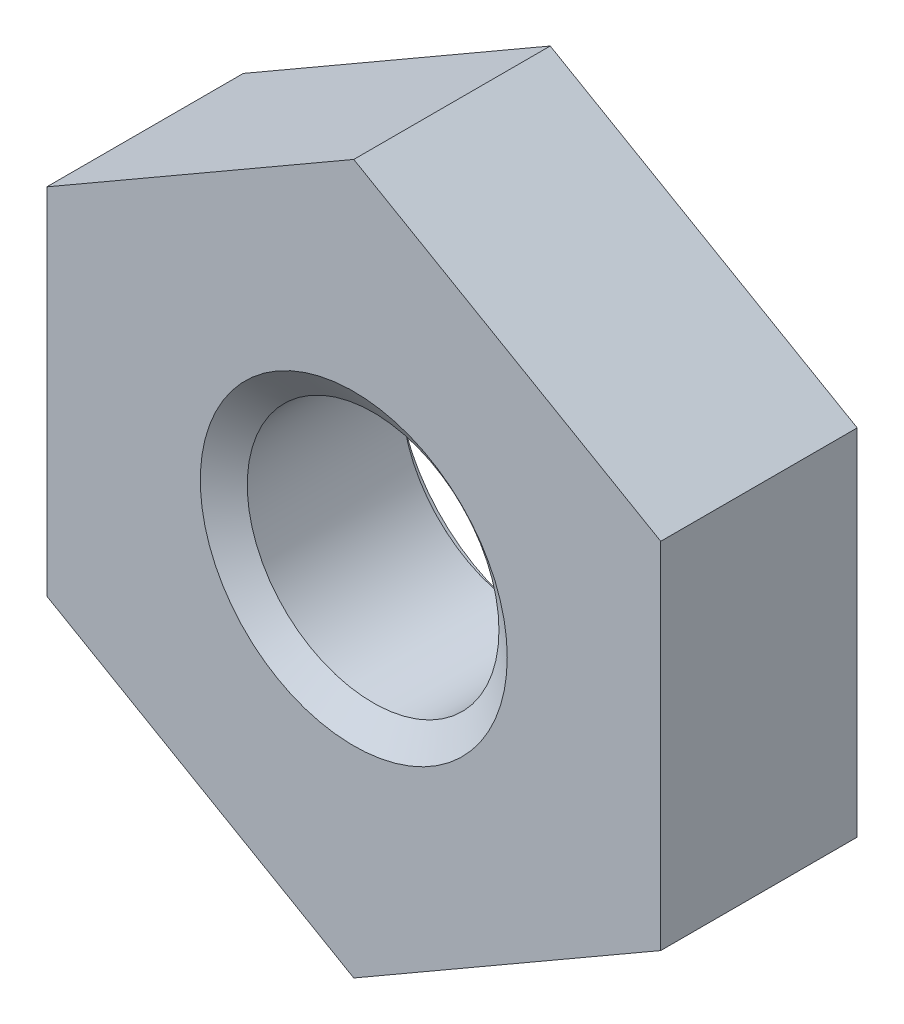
ISO-10303-21;
HEADER;
FILE_DESCRIPTION(('STEP AP214'),'2;1');
FILE_NAME('part.step','',(''),(''),'','','');
FILE_SCHEMA(('AUTOMOTIVE_DESIGN { 1 0 10303 214 1 1 1 1 }'));
ENDSEC;
DATA;
#1=APPLICATION_CONTEXT('core data for automotive mechanical design processes');
#2=APPLICATION_PROTOCOL_DEFINITION('international standard','automotive_design',2000,#1);
#3=PRODUCT_CONTEXT('',#1,'mechanical');
#4=PRODUCT('Part','Part','',(#3));
#5=PRODUCT_RELATED_PRODUCT_CATEGORY('part','',(#4));
#6=PRODUCT_DEFINITION_FORMATION('','',#4);
#7=PRODUCT_DEFINITION_CONTEXT('part definition',#1,'design');
#8=PRODUCT_DEFINITION('design','',#6,#7);
#9=PRODUCT_DEFINITION_SHAPE('','',#8);
#10=(LENGTH_UNIT() NAMED_UNIT(*) SI_UNIT(.MILLI.,.METRE.));
#11=(NAMED_UNIT(*) PLANE_ANGLE_UNIT() SI_UNIT($,.RADIAN.));
#12=(NAMED_UNIT(*) SI_UNIT($,.STERADIAN.) SOLID_ANGLE_UNIT());
#13=UNCERTAINTY_MEASURE_WITH_UNIT(LENGTH_MEASURE(1.E-05),#10,'distance_accuracy_value','');
#14=(GEOMETRIC_REPRESENTATION_CONTEXT(3) GLOBAL_UNCERTAINTY_ASSIGNED_CONTEXT((#13)) GLOBAL_UNIT_ASSIGNED_CONTEXT((#10,
#11,#12)) REPRESENTATION_CONTEXT('',''));
#15=CARTESIAN_POINT('',(0.,0.,0.));
#16=DIRECTION('',(0.,0.,1.));
#17=DIRECTION('',(1.,0.,0.));
#18=AXIS2_PLACEMENT_3D('',#15,#16,#17);
#19=CARTESIAN_POINT('',(0.,0.,-1.6));
#20=DIRECTION('',(0.,0.,1.));
#21=DIRECTION('',(1.,0.,0.));
#22=AXIS2_PLACEMENT_3D('',#19,#20,#21);
#23=CYLINDRICAL_SURFACE('',#22,1.025);
#24=CARTESIAN_POINT('',(0.,0.,-0.157546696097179));
#25=DIRECTION('',(0.,0.,1.));
#26=DIRECTION('',(1.,0.,0.));
#27=AXIS2_PLACEMENT_3D('',#24,#25,#26);
#28=CIRCLE('',#27,1.025);
#29=CARTESIAN_POINT('',(1.025,0.,-0.157546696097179));
#30=VERTEX_POINT('',#29);
#31=EDGE_CURVE('E101',#30,#30,#28,.F.);
#32=ORIENTED_EDGE('',*,*,#31,.F.);
#33=EDGE_LOOP('',(#32));
#34=FACE_BOUND('',#33,.T.);
#35=CARTESIAN_POINT('',(0.,0.,-1.41705330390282));
#36=DIRECTION('',(0.,0.,-1.));
#37=DIRECTION('',(-1.,0.,0.));
#38=AXIS2_PLACEMENT_3D('',#35,#36,#37);
#39=CIRCLE('',#38,1.025);
#40=CARTESIAN_POINT('',(-1.025,0.,-1.41705330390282));
#41=VERTEX_POINT('',#40);
#42=EDGE_CURVE('E30',#41,#41,#39,.F.);
#43=ORIENTED_EDGE('',*,*,#42,.F.);
#44=EDGE_LOOP('',(#43));
#45=FACE_BOUND('',#44,.T.);
#46=ADVANCED_FACE('F26',(#34,#45),#23,.F.);
#47=CARTESIAN_POINT('',(-4.99999999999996,0.,-1.6));
#48=DIRECTION('',(0.,0.,1.));
#49=DIRECTION('',(1.,0.,0.));
#50=AXIS2_PLACEMENT_3D('',#47,#48,#49);
#51=PLANE('',#50);
#52=DIRECTION('',(-0.866025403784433,-0.500000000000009,0.));
#53=VECTOR('',#52,1.);
#54=CARTESIAN_POINT('',(0.,2.88675134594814,-1.6));
#55=LINE('',#54,#53);
#56=CARTESIAN_POINT('',(0.,2.88675134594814,-1.6));
#57=VERTEX_POINT('',#56);
#58=CARTESIAN_POINT('',(-2.5,1.44337567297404,-1.6));
#59=VERTEX_POINT('',#58);
#60=EDGE_CURVE('E82',#57,#59,#55,.T.);
#61=ORIENTED_EDGE('',*,*,#60,.F.);
#62=DIRECTION('',(-0.866025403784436,0.500000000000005,0.));
#63=VECTOR('',#62,1.);
#64=CARTESIAN_POINT('',(2.5,1.44337567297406,-1.6));
#65=LINE('',#64,#63);
#66=CARTESIAN_POINT('',(2.5,1.44337567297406,-1.6));
#67=VERTEX_POINT('',#66);
#68=EDGE_CURVE('E87',#67,#57,#65,.T.);
#69=ORIENTED_EDGE('',*,*,#68,.F.);
#70=DIRECTION('',(0.,-1.,0.));
#71=VECTOR('',#70,1.);
#72=CARTESIAN_POINT('',(2.5,1.44337567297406,-1.6));
#73=LINE('',#72,#71);
#74=CARTESIAN_POINT('',(2.5,-1.44337567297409,-1.6));
#75=VERTEX_POINT('',#74);
#76=EDGE_CURVE('E126',#67,#75,#73,.T.);
#77=ORIENTED_EDGE('',*,*,#76,.T.);
#78=DIRECTION('',(0.866025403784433,0.50000000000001,0.));
#79=VECTOR('',#78,1.);
#80=CARTESIAN_POINT('',(0.,-2.88675134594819,-1.6));
#81=LINE('',#80,#79);
#82=CARTESIAN_POINT('',(0.,-2.88675134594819,-1.6));
#83=VERTEX_POINT('',#82);
#84=EDGE_CURVE('E123',#83,#75,#81,.T.);
#85=ORIENTED_EDGE('',*,*,#84,.F.);
#86=DIRECTION('',(0.866025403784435,-0.500000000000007,0.));
#87=VECTOR('',#86,1.);
#88=CARTESIAN_POINT('',(-2.5,-1.4433756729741,-1.6));
#89=LINE('',#88,#87);
#90=CARTESIAN_POINT('',(-2.5,-1.4433756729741,-1.6));
#91=VERTEX_POINT('',#90);
#92=EDGE_CURVE('E120',#91,#83,#89,.T.);
#93=ORIENTED_EDGE('',*,*,#92,.F.);
#94=DIRECTION('',(0.,-1.,0.));
#95=VECTOR('',#94,1.);
#96=CARTESIAN_POINT('',(-2.5,1.44337567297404,-1.6));
#97=LINE('',#96,#95);
#98=EDGE_CURVE('E118',#59,#91,#97,.T.);
#99=ORIENTED_EDGE('',*,*,#98,.F.);
#100=EDGE_LOOP('',(#61,#69,#77,#85,#93,#99));
#101=FACE_BOUND('',#100,.T.);
#102=CARTESIAN_POINT('',(0.,0.,-1.6));
#103=DIRECTION('',(0.,0.,1.));
#104=DIRECTION('',(1.,0.,0.));
#105=AXIS2_PLACEMENT_3D('',#102,#103,#104);
#106=CIRCLE('',#105,1.25);
#107=CARTESIAN_POINT('',(1.25,0.,-1.6));
#108=VERTEX_POINT('',#107);
#109=EDGE_CURVE('E134',#108,#108,#106,.F.);
#110=ORIENTED_EDGE('',*,*,#109,.F.);
#111=EDGE_LOOP('',(#110));
#112=FACE_BOUND('',#111,.T.);
#113=ADVANCED_FACE('F153',(#101,#112),#51,.F.);
#114=CARTESIAN_POINT('',(-4.99999999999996,0.,0.));
#115=DIRECTION('',(0.,0.,1.));
#116=DIRECTION('',(1.,0.,0.));
#117=AXIS2_PLACEMENT_3D('',#114,#115,#116);
#118=PLANE('',#117);
#119=DIRECTION('',(-0.866025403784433,-0.500000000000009,0.));
#120=VECTOR('',#119,1.);
#121=CARTESIAN_POINT('',(0.,2.88675134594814,0.));
#122=LINE('',#121,#120);
#123=CARTESIAN_POINT('',(0.,2.88675134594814,0.));
#124=VERTEX_POINT('',#123);
#125=CARTESIAN_POINT('',(-2.5,1.44337567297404,0.));
#126=VERTEX_POINT('',#125);
#127=EDGE_CURVE('E80',#124,#126,#122,.T.);
#128=ORIENTED_EDGE('',*,*,#127,.T.);
#129=DIRECTION('',(0.,-1.,0.));
#130=VECTOR('',#129,1.);
#131=CARTESIAN_POINT('',(-2.5,1.44337567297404,0.));
#132=LINE('',#131,#130);
#133=CARTESIAN_POINT('',(-2.5,-1.4433756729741,0.));
#134=VERTEX_POINT('',#133);
#135=EDGE_CURVE('E90',#126,#134,#132,.T.);
#136=ORIENTED_EDGE('',*,*,#135,.T.);
#137=DIRECTION('',(0.866025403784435,-0.500000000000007,0.));
#138=VECTOR('',#137,1.);
#139=CARTESIAN_POINT('',(-2.5,-1.4433756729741,0.));
#140=LINE('',#139,#138);
#141=CARTESIAN_POINT('',(0.,-2.88675134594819,0.));
#142=VERTEX_POINT('',#141);
#143=EDGE_CURVE('E95',#134,#142,#140,.T.);
#144=ORIENTED_EDGE('',*,*,#143,.T.);
#145=DIRECTION('',(0.866025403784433,0.50000000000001,0.));
#146=VECTOR('',#145,1.);
#147=CARTESIAN_POINT('',(0.,-2.88675134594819,0.));
#148=LINE('',#147,#146);
#149=CARTESIAN_POINT('',(2.5,-1.44337567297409,0.));
#150=VERTEX_POINT('',#149);
#151=EDGE_CURVE('E110',#142,#150,#148,.T.);
#152=ORIENTED_EDGE('',*,*,#151,.T.);
#153=DIRECTION('',(0.,-1.,0.));
#154=VECTOR('',#153,1.);
#155=CARTESIAN_POINT('',(2.5,1.44337567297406,0.));
#156=LINE('',#155,#154);
#157=CARTESIAN_POINT('',(2.5,1.44337567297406,0.));
#158=VERTEX_POINT('',#157);
#159=EDGE_CURVE('E113',#158,#150,#156,.T.);
#160=ORIENTED_EDGE('',*,*,#159,.F.);
#161=DIRECTION('',(-0.866025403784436,0.500000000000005,0.));
#162=VECTOR('',#161,1.);
#163=CARTESIAN_POINT('',(2.5,1.44337567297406,0.));
#164=LINE('',#163,#162);
#165=EDGE_CURVE('E100',#158,#124,#164,.T.);
#166=ORIENTED_EDGE('',*,*,#165,.T.);
#167=EDGE_LOOP('',(#128,#136,#144,#152,#160,#166));
#168=FACE_BOUND('',#167,.T.);
#169=CARTESIAN_POINT('',(0.,0.,0.));
#170=DIRECTION('',(0.,0.,1.));
#171=DIRECTION('',(1.,0.,0.));
#172=AXIS2_PLACEMENT_3D('',#169,#170,#171);
#173=CIRCLE('',#172,1.25);
#174=CARTESIAN_POINT('',(1.25,0.,0.));
#175=VERTEX_POINT('',#174);
#176=EDGE_CURVE('E104',#175,#175,#173,.T.);
#177=ORIENTED_EDGE('',*,*,#176,.F.);
#178=EDGE_LOOP('',(#177));
#179=FACE_BOUND('',#178,.T.);
#180=ADVANCED_FACE('F97',(#168,#179),#118,.T.);
#181=CARTESIAN_POINT('',(0.,2.88675134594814,-1.6));
#182=DIRECTION('',(-0.500000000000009,0.866025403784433,0.));
#183=DIRECTION('',(-0.866025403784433,-0.500000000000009,0.));
#184=AXIS2_PLACEMENT_3D('',#181,#182,#183);
#185=PLANE('',#184);
#186=ORIENTED_EDGE('',*,*,#127,.F.);
#187=DIRECTION('',(0.,0.,1.));
#188=VECTOR('',#187,1.);
#189=CARTESIAN_POINT('',(0.,2.88675134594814,-1.6));
#190=LINE('',#189,#188);
#191=EDGE_CURVE('E11',#57,#124,#190,.T.);
#192=ORIENTED_EDGE('',*,*,#191,.F.);
#193=ORIENTED_EDGE('',*,*,#60,.T.);
#194=DIRECTION('',(0.,0.,1.));
#195=VECTOR('',#194,1.);
#196=CARTESIAN_POINT('',(-2.5,1.44337567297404,-1.6));
#197=LINE('',#196,#195);
#198=EDGE_CURVE('E77',#59,#126,#197,.T.);
#199=ORIENTED_EDGE('',*,*,#198,.T.);
#200=EDGE_LOOP('',(#186,#192,#193,#199));
#201=FACE_BOUND('',#200,.T.);
#202=ADVANCED_FACE('F28',(#201),#185,.T.);
#203=CARTESIAN_POINT('',(2.5,1.44337567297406,-1.6));
#204=DIRECTION('',(0.500000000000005,0.866025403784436,0.));
#205=DIRECTION('',(-0.866025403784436,0.500000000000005,0.));
#206=AXIS2_PLACEMENT_3D('',#203,#204,#205);
#207=PLANE('',#206);
#208=ORIENTED_EDGE('',*,*,#165,.F.);
#209=DIRECTION('',(0.,0.,1.));
#210=VECTOR('',#209,1.);
#211=CARTESIAN_POINT('',(2.5,1.44337567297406,-1.6));
#212=LINE('',#211,#210);
#213=EDGE_CURVE('E35',#67,#158,#212,.T.);
#214=ORIENTED_EDGE('',*,*,#213,.F.);
#215=ORIENTED_EDGE('',*,*,#68,.T.);
#216=ORIENTED_EDGE('',*,*,#191,.T.);
#217=EDGE_LOOP('',(#208,#214,#215,#216));
#218=FACE_BOUND('',#217,.T.);
#219=ADVANCED_FACE('F168',(#218),#207,.T.);
#220=CARTESIAN_POINT('',(2.5,1.44337567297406,-1.6));
#221=DIRECTION('',(-1.,0.,0.));
#222=DIRECTION('',(0.,0.,1.));
#223=AXIS2_PLACEMENT_3D('',#220,#221,#222);
#224=PLANE('',#223);
#225=ORIENTED_EDGE('',*,*,#159,.T.);
#226=DIRECTION('',(0.,0.,1.));
#227=VECTOR('',#226,1.);
#228=CARTESIAN_POINT('',(2.5,-1.44337567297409,-1.6));
#229=LINE('',#228,#227);
#230=EDGE_CURVE('E130',#75,#150,#229,.T.);
#231=ORIENTED_EDGE('',*,*,#230,.F.);
#232=ORIENTED_EDGE('',*,*,#76,.F.);
#233=ORIENTED_EDGE('',*,*,#213,.T.);
#234=EDGE_LOOP('',(#225,#231,#232,#233));
#235=FACE_BOUND('',#234,.T.);
#236=ADVANCED_FACE('F171',(#235),#224,.F.);
#237=CARTESIAN_POINT('',(0.,-2.88675134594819,-1.6));
#238=DIRECTION('',(0.50000000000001,-0.866025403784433,0.));
#239=DIRECTION('',(0.866025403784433,0.50000000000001,0.));
#240=AXIS2_PLACEMENT_3D('',#237,#238,#239);
#241=PLANE('',#240);
#242=ORIENTED_EDGE('',*,*,#151,.F.);
#243=DIRECTION('',(0.,0.,1.));
#244=VECTOR('',#243,1.);
#245=CARTESIAN_POINT('',(0.,-2.88675134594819,-1.6));
#246=LINE('',#245,#244);
#247=EDGE_CURVE('E132',#83,#142,#246,.T.);
#248=ORIENTED_EDGE('',*,*,#247,.F.);
#249=ORIENTED_EDGE('',*,*,#84,.T.);
#250=ORIENTED_EDGE('',*,*,#230,.T.);
#251=EDGE_LOOP('',(#242,#248,#249,#250));
#252=FACE_BOUND('',#251,.T.);
#253=ADVANCED_FACE('F174',(#252),#241,.T.);
#254=CARTESIAN_POINT('',(-2.5,-1.4433756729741,-1.6));
#255=DIRECTION('',(-0.500000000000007,-0.866025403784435,0.));
#256=DIRECTION('',(0.866025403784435,-0.500000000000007,0.));
#257=AXIS2_PLACEMENT_3D('',#254,#255,#256);
#258=PLANE('',#257);
#259=ORIENTED_EDGE('',*,*,#143,.F.);
#260=DIRECTION('',(0.,0.,1.));
#261=VECTOR('',#260,1.);
#262=CARTESIAN_POINT('',(-2.5,-1.4433756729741,-1.6));
#263=LINE('',#262,#261);
#264=EDGE_CURVE('E86',#91,#134,#263,.T.);
#265=ORIENTED_EDGE('',*,*,#264,.F.);
#266=ORIENTED_EDGE('',*,*,#92,.T.);
#267=ORIENTED_EDGE('',*,*,#247,.T.);
#268=EDGE_LOOP('',(#259,#265,#266,#267));
#269=FACE_BOUND('',#268,.T.);
#270=ADVANCED_FACE('F178',(#269),#258,.T.);
#271=CARTESIAN_POINT('',(-2.5,1.44337567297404,-1.6));
#272=DIRECTION('',(-1.,0.,0.));
#273=DIRECTION('',(0.,0.,1.));
#274=AXIS2_PLACEMENT_3D('',#271,#272,#273);
#275=PLANE('',#274);
#276=ORIENTED_EDGE('',*,*,#135,.F.);
#277=ORIENTED_EDGE('',*,*,#198,.F.);
#278=ORIENTED_EDGE('',*,*,#98,.T.);
#279=ORIENTED_EDGE('',*,*,#264,.T.);
#280=EDGE_LOOP('',(#276,#277,#278,#279));
#281=FACE_BOUND('',#280,.T.);
#282=ADVANCED_FACE('F91',(#281),#275,.T.);
#283=CARTESIAN_POINT('',(0.,0.,-0.173301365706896));
#284=DIRECTION('',(0.,0.,1.));
#285=DIRECTION('',(1.,0.,0.));
#286=AXIS2_PLACEMENT_3D('',#283,#284,#285);
#287=CONICAL_SURFACE('',#286,1.0025,0.959931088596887);
#288=ORIENTED_EDGE('',*,*,#176,.T.);
#289=EDGE_LOOP('',(#288));
#290=FACE_BOUND('',#289,.T.);
#291=ORIENTED_EDGE('',*,*,#31,.T.);
#292=EDGE_LOOP('',(#291));
#293=FACE_BOUND('',#292,.T.);
#294=ADVANCED_FACE('F148',(#290,#293),#287,.F.);
#295=CARTESIAN_POINT('',(0.,0.,-1.5746));
#296=DIRECTION('',(0.,0.,-1.));
#297=DIRECTION('',(-1.,0.,0.));
#298=AXIS2_PLACEMENT_3D('',#295,#296,#297);
#299=CONICAL_SURFACE('',#298,1.25,0.959931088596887);
#300=CARTESIAN_POINT('',(0.,0.,-1.5746));
#301=DIRECTION('',(0.,0.,1.));
#302=DIRECTION('',(1.,0.,0.));
#303=AXIS2_PLACEMENT_3D('',#300,#301,#302);
#304=CIRCLE('',#303,1.25);
#305=CARTESIAN_POINT('',(1.25,0.,-1.5746));
#306=VERTEX_POINT('',#305);
#307=EDGE_CURVE('E136',#306,#306,#304,.T.);
#308=ORIENTED_EDGE('',*,*,#307,.F.);
#309=EDGE_LOOP('',(#308));
#310=FACE_BOUND('',#309,.T.);
#311=ORIENTED_EDGE('',*,*,#42,.T.);
#312=EDGE_LOOP('',(#311));
#313=FACE_BOUND('',#312,.T.);
#314=ADVANCED_FACE('F145',(#310,#313),#299,.F.);
#315=CARTESIAN_POINT('',(0.,0.,-25.0375057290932));
#316=DIRECTION('',(0.,0.,1.));
#317=DIRECTION('',(1.,0.,0.));
#318=AXIS2_PLACEMENT_3D('',#315,#316,#317);
#319=CYLINDRICAL_SURFACE('',#318,1.25);
#320=ORIENTED_EDGE('',*,*,#307,.T.);
#321=EDGE_LOOP('',(#320));
#322=FACE_BOUND('',#321,.T.);
#323=ORIENTED_EDGE('',*,*,#109,.T.);
#324=EDGE_LOOP('',(#323));
#325=FACE_BOUND('',#324,.T.);
#326=ADVANCED_FACE('F143',(#322,#325),#319,.F.);
#327=CLOSED_SHELL('',(#46,#113,#180,#202,#219,#236,#253,#270,#282,#294,#314,#326));
#328=MANIFOLD_SOLID_BREP('B2',#327);
#329=ADVANCED_BREP_SHAPE_REPRESENTATION('',(#18,#328),#14);
#330=SHAPE_DEFINITION_REPRESENTATION(#9,#329);
ENDSEC;
END-ISO-10303-21;
